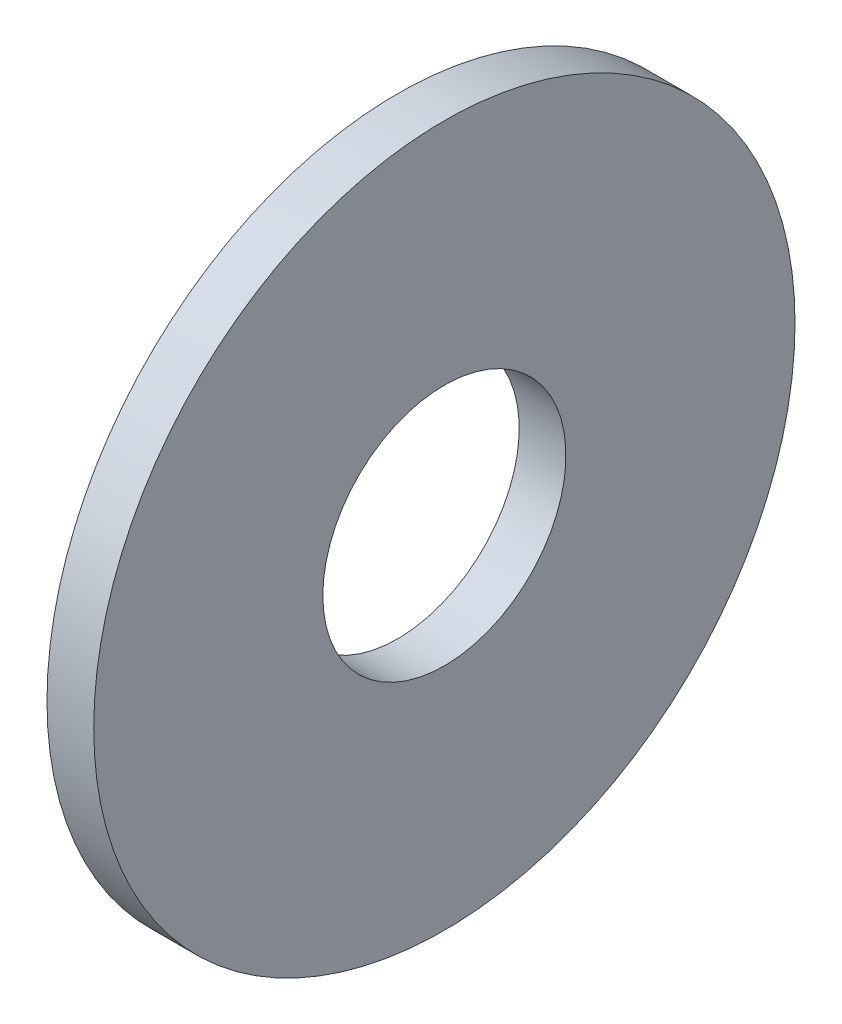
from build123d import *

# Parameters (mm, degrees)
ESQUISSE2_W = 2
ESQUISSE2_H = 9.8


with BuildPart() as part:
    # Esquisse2 → R_volution1 (revolve)
    with BuildSketch(Plane.XY, mode=Mode.PRIVATE) as r_volution1_sk:
        with Locations((1, 10.1)):
            Rectangle(ESQUISSE2_W, ESQUISSE2_H)
    revolve(r_volution1_sk.sketch.rotate(Axis((-7.455836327, 0, 0), (1, 0, 0)), 90), axis=Axis((-7.455836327, 0, 0), (1, 0, 0)))


solid = part.part
